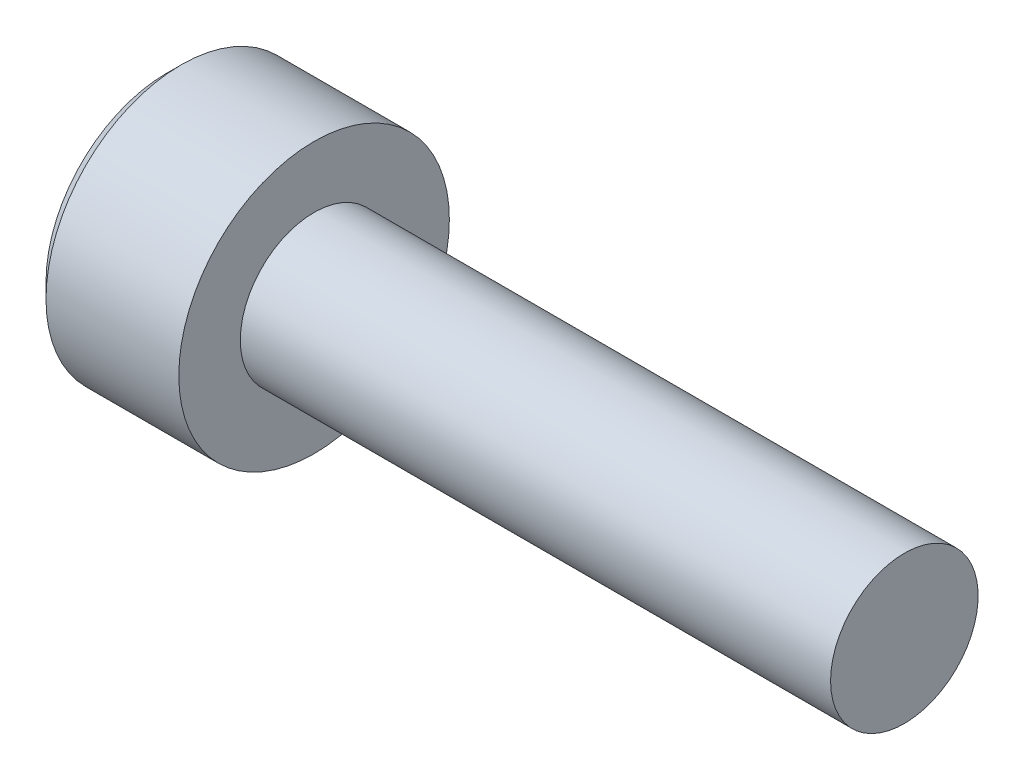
from build123d import *

# Parameters (mm, degrees)
CHAMFER1_SIZE      = 0.3
CUT_EXTRUDE1_DEPTH = 1.3


with BuildPart() as part:
    # Sketch1 → Revolve1 (revolve)
    with BuildSketch(Plane.XY, mode=Mode.PRIVATE) as revolve1_sk:
        Polygon((-3, 0), (12, 0), (12, 1.5), (0, 1.5), (0, 2.75), (-3, 2.75), align=None)
    revolve(revolve1_sk.sketch.rotate(Axis((-3, 0, 0), (1, 0, 0)), 90), axis=Axis((-3, 0, 0), (1, 0, 0)))

    # Chamfer1
    chamfer1_edges = [part.edges().sort_by_distance(p)[0] for p in [
        (-3, 0, -2.75),
    ]]
    chamfer(chamfer1_edges, length=CHAMFER1_SIZE)

    # Sketch2 → Cut-Revolve1 (revolve, cut)
    with BuildSketch(Plane.XY, mode=Mode.PRIVATE) as cut_revolve1_sk:
        Polygon((-0.948924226, 0), (-1.7, 1.25), (-3, 1.25), (-3, 0), align=None)
    revolve(cut_revolve1_sk.sketch.rotate(Axis((-3, 0, 0), (1, 0, 0)), 180), axis=Axis((-3, 0, 0), (1, 0, 0)), mode=Mode.SUBTRACT)

    # Sketch3 → Cut-Extrude1 (cut)
    with BuildSketch(Plane.ZY.offset(3)):
        Polygon((0, -1.443375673), (1.25, -0.721687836), (1.25, 0.721687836), (0, 1.443375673), (-1.25, 0.721687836), (-1.25, -0.721687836), align=None)
    extrude(amount=-CUT_EXTRUDE1_DEPTH, mode=Mode.SUBTRACT)


solid = part.part
